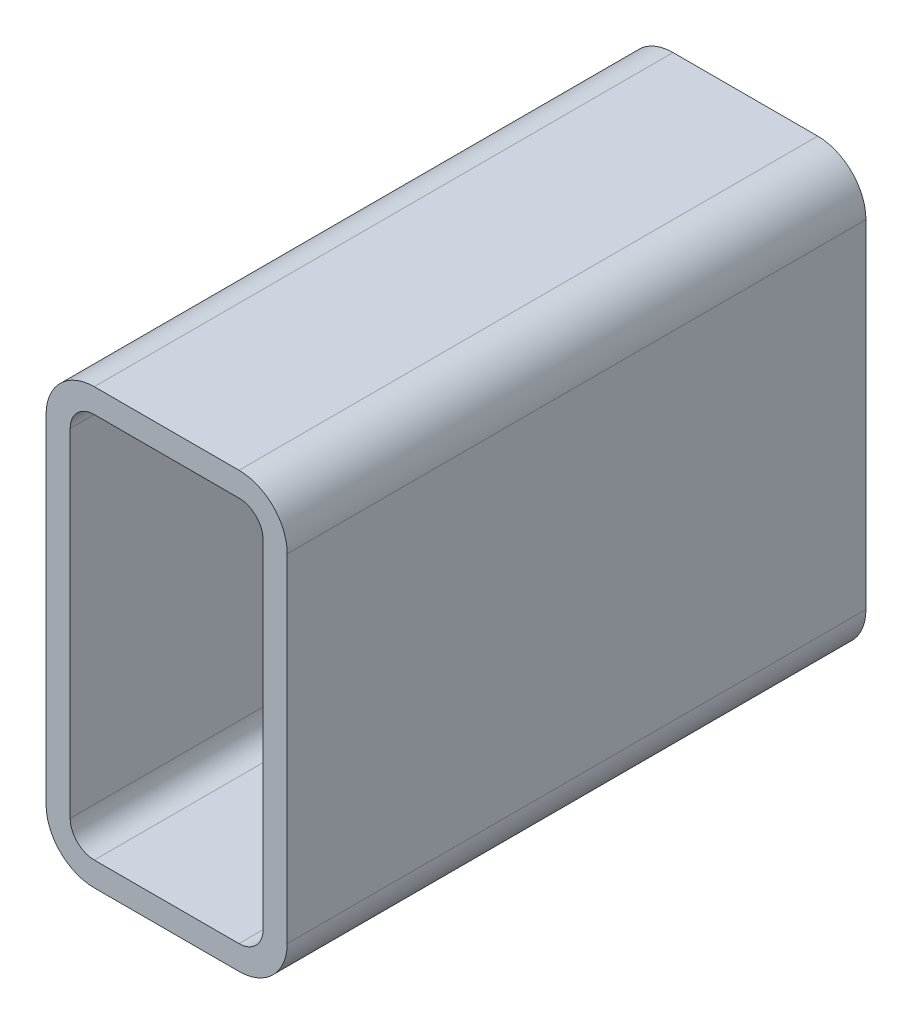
ISO-10303-21;
HEADER;
FILE_DESCRIPTION(('STEP AP214'),'2;1');
FILE_NAME('part.step','',(''),(''),'','','');
FILE_SCHEMA(('AUTOMOTIVE_DESIGN { 1 0 10303 214 1 1 1 1 }'));
ENDSEC;
DATA;
#1=APPLICATION_CONTEXT('core data for automotive mechanical design processes');
#2=APPLICATION_PROTOCOL_DEFINITION('international standard','automotive_design',2000,#1);
#3=PRODUCT_CONTEXT('',#1,'mechanical');
#4=PRODUCT('Part','Part','',(#3));
#5=PRODUCT_RELATED_PRODUCT_CATEGORY('part','',(#4));
#6=PRODUCT_DEFINITION_FORMATION('','',#4);
#7=PRODUCT_DEFINITION_CONTEXT('part definition',#1,'design');
#8=PRODUCT_DEFINITION('design','',#6,#7);
#9=PRODUCT_DEFINITION_SHAPE('','',#8);
#10=(LENGTH_UNIT() NAMED_UNIT(*) SI_UNIT(.MILLI.,.METRE.));
#11=(NAMED_UNIT(*) PLANE_ANGLE_UNIT() SI_UNIT($,.RADIAN.));
#12=(NAMED_UNIT(*) SI_UNIT($,.STERADIAN.) SOLID_ANGLE_UNIT());
#13=UNCERTAINTY_MEASURE_WITH_UNIT(LENGTH_MEASURE(1.E-05),#10,'distance_accuracy_value','');
#14=(GEOMETRIC_REPRESENTATION_CONTEXT(3) GLOBAL_UNCERTAINTY_ASSIGNED_CONTEXT((#13)) GLOBAL_UNIT_ASSIGNED_CONTEXT((#10,
#11,#12)) REPRESENTATION_CONTEXT('',''));
#15=CARTESIAN_POINT('',(0.,0.,0.));
#16=DIRECTION('',(0.,0.,1.));
#17=DIRECTION('',(1.,0.,0.));
#18=AXIS2_PLACEMENT_3D('',#15,#16,#17);
#19=CARTESIAN_POINT('',(26.2612396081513,205.143222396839,304.8));
#20=DIRECTION('',(0.,0.,1.));
#21=DIRECTION('',(1.,0.,0.));
#22=AXIS2_PLACEMENT_3D('',#19,#20,#21);
#23=PLANE('',#22);
#24=CARTESIAN_POINT('',(26.2612396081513,205.143222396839,304.8));
#25=DIRECTION('',(0.,0.,1.));
#26=DIRECTION('',(1.,0.,0.));
#27=AXIS2_PLACEMENT_3D('',#24,#25,#26);
#28=CIRCLE('',#27,25.4);
#29=CARTESIAN_POINT('',(26.2612396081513,230.543222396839,304.8));
#30=VERTEX_POINT('',#29);
#31=CARTESIAN_POINT('',(0.8612396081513,205.143222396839,304.8));
#32=VERTEX_POINT('',#31);
#33=EDGE_CURVE('E211',#30,#32,#28,.T.);
#34=ORIENTED_EDGE('',*,*,#33,.T.);
#35=DIRECTION('',(0.,-1.,0.));
#36=VECTOR('',#35,1.);
#37=CARTESIAN_POINT('',(0.8612396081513,27.3432223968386,304.8));
#38=LINE('',#37,#36);
#39=CARTESIAN_POINT('',(0.861239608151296,27.3432223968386,304.8));
#40=VERTEX_POINT('',#39);
#41=EDGE_CURVE('E214',#32,#40,#38,.T.);
#42=ORIENTED_EDGE('',*,*,#41,.T.);
#43=CARTESIAN_POINT('',(26.2612396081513,27.3432223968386,304.8));
#44=DIRECTION('',(0.,0.,1.));
#45=DIRECTION('',(1.,0.,0.));
#46=AXIS2_PLACEMENT_3D('',#43,#44,#45);
#47=CIRCLE('',#46,25.4);
#48=CARTESIAN_POINT('',(26.2612396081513,1.94322239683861,304.8));
#49=VERTEX_POINT('',#48);
#50=EDGE_CURVE('E217',#40,#49,#47,.T.);
#51=ORIENTED_EDGE('',*,*,#50,.T.);
#52=DIRECTION('',(1.,0.,0.));
#53=VECTOR('',#52,1.);
#54=CARTESIAN_POINT('',(102.461239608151,1.94322239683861,304.8));
#55=LINE('',#54,#53);
#56=CARTESIAN_POINT('',(102.461239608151,1.94322239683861,304.8));
#57=VERTEX_POINT('',#56);
#58=EDGE_CURVE('E219',#49,#57,#55,.T.);
#59=ORIENTED_EDGE('',*,*,#58,.T.);
#60=CARTESIAN_POINT('',(102.461239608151,27.3432223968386,304.8));
#61=DIRECTION('',(0.,0.,1.));
#62=DIRECTION('',(1.,0.,0.));
#63=AXIS2_PLACEMENT_3D('',#60,#61,#62);
#64=CIRCLE('',#63,25.4);
#65=CARTESIAN_POINT('',(127.861239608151,27.3432223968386,304.8));
#66=VERTEX_POINT('',#65);
#67=EDGE_CURVE('E221',#57,#66,#64,.T.);
#68=ORIENTED_EDGE('',*,*,#67,.T.);
#69=DIRECTION('',(0.,1.,0.));
#70=VECTOR('',#69,1.);
#71=CARTESIAN_POINT('',(127.861239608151,205.143222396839,304.8));
#72=LINE('',#71,#70);
#73=CARTESIAN_POINT('',(127.861239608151,205.143222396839,304.8));
#74=VERTEX_POINT('',#73);
#75=EDGE_CURVE('E223',#66,#74,#72,.T.);
#76=ORIENTED_EDGE('',*,*,#75,.T.);
#77=CARTESIAN_POINT('',(102.461239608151,205.143222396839,304.8));
#78=DIRECTION('',(0.,0.,1.));
#79=DIRECTION('',(1.,0.,0.));
#80=AXIS2_PLACEMENT_3D('',#77,#78,#79);
#81=CIRCLE('',#80,25.4);
#82=CARTESIAN_POINT('',(102.461239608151,230.543222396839,304.8));
#83=VERTEX_POINT('',#82);
#84=EDGE_CURVE('E225',#74,#83,#81,.T.);
#85=ORIENTED_EDGE('',*,*,#84,.T.);
#86=DIRECTION('',(-1.,0.,0.));
#87=VECTOR('',#86,1.);
#88=CARTESIAN_POINT('',(26.2612396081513,230.543222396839,304.8));
#89=LINE('',#88,#87);
#90=EDGE_CURVE('E227',#83,#30,#89,.T.);
#91=ORIENTED_EDGE('',*,*,#90,.T.);
#92=EDGE_LOOP('',(#34,#42,#51,#59,#68,#76,#85,#91));
#93=FACE_BOUND('',#92,.T.);
#94=DIRECTION('',(0.,-1.,0.));
#95=VECTOR('',#94,1.);
#96=CARTESIAN_POINT('',(13.5612396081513,27.3432223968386,304.8));
#97=LINE('',#96,#95);
#98=CARTESIAN_POINT('',(13.5612396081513,205.143222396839,304.8));
#99=VERTEX_POINT('',#98);
#100=CARTESIAN_POINT('',(13.5612396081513,27.3432223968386,304.8));
#101=VERTEX_POINT('',#100);
#102=EDGE_CURVE('E154',#99,#101,#97,.T.);
#103=ORIENTED_EDGE('',*,*,#102,.F.);
#104=CARTESIAN_POINT('',(26.2612396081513,205.143222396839,304.8));
#105=DIRECTION('',(0.,0.,1.));
#106=DIRECTION('',(1.,0.,0.));
#107=AXIS2_PLACEMENT_3D('',#104,#105,#106);
#108=CIRCLE('',#107,12.7);
#109=CARTESIAN_POINT('',(26.2612396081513,217.843222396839,304.8));
#110=VERTEX_POINT('',#109);
#111=EDGE_CURVE('E146',#110,#99,#108,.T.);
#112=ORIENTED_EDGE('',*,*,#111,.F.);
#113=DIRECTION('',(-1.,0.,0.));
#114=VECTOR('',#113,1.);
#115=CARTESIAN_POINT('',(26.2612396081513,217.843222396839,304.8));
#116=LINE('',#115,#114);
#117=CARTESIAN_POINT('',(102.461239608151,217.843222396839,304.8));
#118=VERTEX_POINT('',#117);
#119=EDGE_CURVE('E179',#118,#110,#116,.T.);
#120=ORIENTED_EDGE('',*,*,#119,.F.);
#121=CARTESIAN_POINT('',(102.461239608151,205.143222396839,304.8));
#122=DIRECTION('',(0.,0.,1.));
#123=DIRECTION('',(1.,0.,0.));
#124=AXIS2_PLACEMENT_3D('',#121,#122,#123);
#125=CIRCLE('',#124,12.7);
#126=CARTESIAN_POINT('',(115.161239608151,205.143222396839,304.8));
#127=VERTEX_POINT('',#126);
#128=EDGE_CURVE('E177',#127,#118,#125,.T.);
#129=ORIENTED_EDGE('',*,*,#128,.F.);
#130=DIRECTION('',(0.,1.,0.));
#131=VECTOR('',#130,1.);
#132=CARTESIAN_POINT('',(115.161239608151,205.143222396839,304.8));
#133=LINE('',#132,#131);
#134=CARTESIAN_POINT('',(115.161239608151,27.3432223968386,304.8));
#135=VERTEX_POINT('',#134);
#136=EDGE_CURVE('E175',#135,#127,#133,.T.);
#137=ORIENTED_EDGE('',*,*,#136,.F.);
#138=CARTESIAN_POINT('',(102.461239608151,27.3432223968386,304.8));
#139=DIRECTION('',(0.,0.,1.));
#140=DIRECTION('',(1.,0.,0.));
#141=AXIS2_PLACEMENT_3D('',#138,#139,#140);
#142=CIRCLE('',#141,12.7);
#143=CARTESIAN_POINT('',(102.461239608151,14.6432223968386,304.8));
#144=VERTEX_POINT('',#143);
#145=EDGE_CURVE('E173',#144,#135,#142,.T.);
#146=ORIENTED_EDGE('',*,*,#145,.F.);
#147=DIRECTION('',(1.,0.,0.));
#148=VECTOR('',#147,1.);
#149=CARTESIAN_POINT('',(102.461239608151,14.6432223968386,304.8));
#150=LINE('',#149,#148);
#151=CARTESIAN_POINT('',(26.2612396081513,14.6432223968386,304.8));
#152=VERTEX_POINT('',#151);
#153=EDGE_CURVE('E169',#152,#144,#150,.T.);
#154=ORIENTED_EDGE('',*,*,#153,.F.);
#155=CARTESIAN_POINT('',(26.2612396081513,27.3432223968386,304.8));
#156=DIRECTION('',(0.,0.,1.));
#157=DIRECTION('',(1.,0.,0.));
#158=AXIS2_PLACEMENT_3D('',#155,#156,#157);
#159=CIRCLE('',#158,12.7);
#160=EDGE_CURVE('E167',#101,#152,#159,.T.);
#161=ORIENTED_EDGE('',*,*,#160,.F.);
#162=EDGE_LOOP('',(#103,#112,#120,#129,#137,#146,#154,#161));
#163=FACE_BOUND('',#162,.T.);
#164=ADVANCED_FACE('F33',(#93,#163),#23,.T.);
#165=CARTESIAN_POINT('',(26.2612396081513,205.143222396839,0.));
#166=DIRECTION('',(0.,0.,1.));
#167=DIRECTION('',(1.,0.,0.));
#168=AXIS2_PLACEMENT_3D('',#165,#166,#167);
#169=PLANE('',#168);
#170=CARTESIAN_POINT('',(26.2612396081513,205.143222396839,0.));
#171=DIRECTION('',(0.,0.,1.));
#172=DIRECTION('',(1.,0.,0.));
#173=AXIS2_PLACEMENT_3D('',#170,#171,#172);
#174=CIRCLE('',#173,25.4);
#175=CARTESIAN_POINT('',(26.2612396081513,230.543222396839,0.));
#176=VERTEX_POINT('',#175);
#177=CARTESIAN_POINT('',(0.8612396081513,205.143222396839,0.));
#178=VERTEX_POINT('',#177);
#179=EDGE_CURVE('E162',#176,#178,#174,.T.);
#180=ORIENTED_EDGE('',*,*,#179,.F.);
#181=DIRECTION('',(-1.,0.,0.));
#182=VECTOR('',#181,1.);
#183=CARTESIAN_POINT('',(26.2612396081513,230.543222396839,0.));
#184=LINE('',#183,#182);
#185=CARTESIAN_POINT('',(102.461239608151,230.543222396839,0.));
#186=VERTEX_POINT('',#185);
#187=EDGE_CURVE('E215',#186,#176,#184,.T.);
#188=ORIENTED_EDGE('',*,*,#187,.F.);
#189=CARTESIAN_POINT('',(102.461239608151,205.143222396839,0.));
#190=DIRECTION('',(0.,0.,1.));
#191=DIRECTION('',(1.,0.,0.));
#192=AXIS2_PLACEMENT_3D('',#189,#190,#191);
#193=CIRCLE('',#192,25.4);
#194=CARTESIAN_POINT('',(127.861239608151,205.143222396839,0.));
#195=VERTEX_POINT('',#194);
#196=EDGE_CURVE('E242',#195,#186,#193,.T.);
#197=ORIENTED_EDGE('',*,*,#196,.F.);
#198=DIRECTION('',(0.,1.,0.));
#199=VECTOR('',#198,1.);
#200=CARTESIAN_POINT('',(127.861239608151,205.143222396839,0.));
#201=LINE('',#200,#199);
#202=CARTESIAN_POINT('',(127.861239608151,27.3432223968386,0.));
#203=VERTEX_POINT('',#202);
#204=EDGE_CURVE('E240',#203,#195,#201,.T.);
#205=ORIENTED_EDGE('',*,*,#204,.F.);
#206=CARTESIAN_POINT('',(102.461239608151,27.3432223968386,0.));
#207=DIRECTION('',(0.,0.,1.));
#208=DIRECTION('',(1.,0.,0.));
#209=AXIS2_PLACEMENT_3D('',#206,#207,#208);
#210=CIRCLE('',#209,25.4);
#211=CARTESIAN_POINT('',(102.461239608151,1.94322239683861,0.));
#212=VERTEX_POINT('',#211);
#213=EDGE_CURVE('E238',#212,#203,#210,.T.);
#214=ORIENTED_EDGE('',*,*,#213,.F.);
#215=DIRECTION('',(1.,0.,0.));
#216=VECTOR('',#215,1.);
#217=CARTESIAN_POINT('',(102.461239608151,1.94322239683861,0.));
#218=LINE('',#217,#216);
#219=CARTESIAN_POINT('',(26.2612396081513,1.94322239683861,0.));
#220=VERTEX_POINT('',#219);
#221=EDGE_CURVE('E236',#220,#212,#218,.T.);
#222=ORIENTED_EDGE('',*,*,#221,.F.);
#223=CARTESIAN_POINT('',(26.2612396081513,27.3432223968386,0.));
#224=DIRECTION('',(0.,0.,1.));
#225=DIRECTION('',(1.,0.,0.));
#226=AXIS2_PLACEMENT_3D('',#223,#224,#225);
#227=CIRCLE('',#226,25.4);
#228=CARTESIAN_POINT('',(0.861239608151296,27.3432223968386,0.));
#229=VERTEX_POINT('',#228);
#230=EDGE_CURVE('E234',#229,#220,#227,.T.);
#231=ORIENTED_EDGE('',*,*,#230,.F.);
#232=DIRECTION('',(0.,-1.,0.));
#233=VECTOR('',#232,1.);
#234=CARTESIAN_POINT('',(0.8612396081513,27.3432223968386,0.));
#235=LINE('',#234,#233);
#236=EDGE_CURVE('E232',#178,#229,#235,.T.);
#237=ORIENTED_EDGE('',*,*,#236,.F.);
#238=EDGE_LOOP('',(#180,#188,#197,#205,#214,#222,#231,#237));
#239=FACE_BOUND('',#238,.T.);
#240=CARTESIAN_POINT('',(26.2612396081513,205.143222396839,0.));
#241=DIRECTION('',(0.,0.,1.));
#242=DIRECTION('',(1.,0.,0.));
#243=AXIS2_PLACEMENT_3D('',#240,#241,#242);
#244=CIRCLE('',#243,12.7);
#245=CARTESIAN_POINT('',(26.2612396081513,217.843222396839,0.));
#246=VERTEX_POINT('',#245);
#247=CARTESIAN_POINT('',(13.5612396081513,205.143222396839,0.));
#248=VERTEX_POINT('',#247);
#249=EDGE_CURVE('E56',#246,#248,#244,.T.);
#250=ORIENTED_EDGE('',*,*,#249,.T.);
#251=DIRECTION('',(0.,-1.,0.));
#252=VECTOR('',#251,1.);
#253=CARTESIAN_POINT('',(13.5612396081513,27.3432223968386,0.));
#254=LINE('',#253,#252);
#255=CARTESIAN_POINT('',(13.5612396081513,27.3432223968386,0.));
#256=VERTEX_POINT('',#255);
#257=EDGE_CURVE('E161',#248,#256,#254,.T.);
#258=ORIENTED_EDGE('',*,*,#257,.T.);
#259=CARTESIAN_POINT('',(26.2612396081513,27.3432223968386,0.));
#260=DIRECTION('',(0.,0.,1.));
#261=DIRECTION('',(1.,0.,0.));
#262=AXIS2_PLACEMENT_3D('',#259,#260,#261);
#263=CIRCLE('',#262,12.7);
#264=CARTESIAN_POINT('',(26.2612396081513,14.6432223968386,0.));
#265=VERTEX_POINT('',#264);
#266=EDGE_CURVE('E183',#256,#265,#263,.T.);
#267=ORIENTED_EDGE('',*,*,#266,.T.);
#268=DIRECTION('',(1.,0.,0.));
#269=VECTOR('',#268,1.);
#270=CARTESIAN_POINT('',(102.461239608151,14.6432223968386,0.));
#271=LINE('',#270,#269);
#272=CARTESIAN_POINT('',(102.461239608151,14.6432223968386,0.));
#273=VERTEX_POINT('',#272);
#274=EDGE_CURVE('E186',#265,#273,#271,.T.);
#275=ORIENTED_EDGE('',*,*,#274,.T.);
#276=CARTESIAN_POINT('',(102.461239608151,27.3432223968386,0.));
#277=DIRECTION('',(0.,0.,1.));
#278=DIRECTION('',(1.,0.,0.));
#279=AXIS2_PLACEMENT_3D('',#276,#277,#278);
#280=CIRCLE('',#279,12.7);
#281=CARTESIAN_POINT('',(115.161239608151,27.3432223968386,0.));
#282=VERTEX_POINT('',#281);
#283=EDGE_CURVE('E189',#273,#282,#280,.T.);
#284=ORIENTED_EDGE('',*,*,#283,.T.);
#285=DIRECTION('',(0.,1.,0.));
#286=VECTOR('',#285,1.);
#287=CARTESIAN_POINT('',(115.161239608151,205.143222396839,0.));
#288=LINE('',#287,#286);
#289=CARTESIAN_POINT('',(115.161239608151,205.143222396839,0.));
#290=VERTEX_POINT('',#289);
#291=EDGE_CURVE('E192',#282,#290,#288,.T.);
#292=ORIENTED_EDGE('',*,*,#291,.T.);
#293=CARTESIAN_POINT('',(102.461239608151,205.143222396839,0.));
#294=DIRECTION('',(0.,0.,1.));
#295=DIRECTION('',(1.,0.,0.));
#296=AXIS2_PLACEMENT_3D('',#293,#294,#295);
#297=CIRCLE('',#296,12.7);
#298=CARTESIAN_POINT('',(102.461239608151,217.843222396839,0.));
#299=VERTEX_POINT('',#298);
#300=EDGE_CURVE('E195',#290,#299,#297,.T.);
#301=ORIENTED_EDGE('',*,*,#300,.T.);
#302=DIRECTION('',(-1.,0.,0.));
#303=VECTOR('',#302,1.);
#304=CARTESIAN_POINT('',(26.2612396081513,217.843222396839,0.));
#305=LINE('',#304,#303);
#306=EDGE_CURVE('E155',#299,#246,#305,.T.);
#307=ORIENTED_EDGE('',*,*,#306,.T.);
#308=EDGE_LOOP('',(#250,#258,#267,#275,#284,#292,#301,#307));
#309=FACE_BOUND('',#308,.T.);
#310=ADVANCED_FACE('F272',(#239,#309),#169,.F.);
#311=CARTESIAN_POINT('',(26.2612396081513,205.143222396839,304.8));
#312=DIRECTION('',(0.,0.,-1.));
#313=DIRECTION('',(-1.,0.,0.));
#314=AXIS2_PLACEMENT_3D('',#311,#312,#313);
#315=CYLINDRICAL_SURFACE('',#314,25.4);
#316=ORIENTED_EDGE('',*,*,#179,.T.);
#317=DIRECTION('',(0.,0.,-1.));
#318=VECTOR('',#317,1.);
#319=CARTESIAN_POINT('',(0.8612396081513,205.143222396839,304.8));
#320=LINE('',#319,#318);
#321=EDGE_CURVE('E11',#32,#178,#320,.T.);
#322=ORIENTED_EDGE('',*,*,#321,.F.);
#323=ORIENTED_EDGE('',*,*,#33,.F.);
#324=DIRECTION('',(0.,0.,-1.));
#325=VECTOR('',#324,1.);
#326=CARTESIAN_POINT('',(26.2612396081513,230.543222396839,304.8));
#327=LINE('',#326,#325);
#328=EDGE_CURVE('E229',#30,#176,#327,.T.);
#329=ORIENTED_EDGE('',*,*,#328,.T.);
#330=EDGE_LOOP('',(#316,#322,#323,#329));
#331=FACE_BOUND('',#330,.T.);
#332=ADVANCED_FACE('F35',(#331),#315,.T.);
#333=CARTESIAN_POINT('',(0.8612396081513,27.3432223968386,304.8));
#334=DIRECTION('',(1.,0.,0.));
#335=DIRECTION('',(0.,0.,-1.));
#336=AXIS2_PLACEMENT_3D('',#333,#334,#335);
#337=PLANE('',#336);
#338=ORIENTED_EDGE('',*,*,#236,.T.);
#339=DIRECTION('',(0.,0.,-1.));
#340=VECTOR('',#339,1.);
#341=CARTESIAN_POINT('',(0.861239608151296,27.3432223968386,304.8));
#342=LINE('',#341,#340);
#343=EDGE_CURVE('E41',#40,#229,#342,.T.);
#344=ORIENTED_EDGE('',*,*,#343,.F.);
#345=ORIENTED_EDGE('',*,*,#41,.F.);
#346=ORIENTED_EDGE('',*,*,#321,.T.);
#347=EDGE_LOOP('',(#338,#344,#345,#346));
#348=FACE_BOUND('',#347,.T.);
#349=ADVANCED_FACE('F289',(#348),#337,.F.);
#350=CARTESIAN_POINT('',(26.2612396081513,27.3432223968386,304.8));
#351=DIRECTION('',(0.,0.,-1.));
#352=DIRECTION('',(-1.,0.,0.));
#353=AXIS2_PLACEMENT_3D('',#350,#351,#352);
#354=CYLINDRICAL_SURFACE('',#353,25.4);
#355=ORIENTED_EDGE('',*,*,#230,.T.);
#356=DIRECTION('',(0.,0.,-1.));
#357=VECTOR('',#356,1.);
#358=CARTESIAN_POINT('',(26.2612396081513,1.94322239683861,304.8));
#359=LINE('',#358,#357);
#360=EDGE_CURVE('E259',#49,#220,#359,.T.);
#361=ORIENTED_EDGE('',*,*,#360,.F.);
#362=ORIENTED_EDGE('',*,*,#50,.F.);
#363=ORIENTED_EDGE('',*,*,#343,.T.);
#364=EDGE_LOOP('',(#355,#361,#362,#363));
#365=FACE_BOUND('',#364,.T.);
#366=ADVANCED_FACE('F266',(#365),#354,.T.);
#367=CARTESIAN_POINT('',(102.461239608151,1.94322239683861,304.8));
#368=DIRECTION('',(0.,1.,0.));
#369=DIRECTION('',(0.,0.,1.));
#370=AXIS2_PLACEMENT_3D('',#367,#368,#369);
#371=PLANE('',#370);
#372=ORIENTED_EDGE('',*,*,#221,.T.);
#373=DIRECTION('',(0.,0.,-1.));
#374=VECTOR('',#373,1.);
#375=CARTESIAN_POINT('',(102.461239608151,1.94322239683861,304.8));
#376=LINE('',#375,#374);
#377=EDGE_CURVE('E256',#57,#212,#376,.T.);
#378=ORIENTED_EDGE('',*,*,#377,.F.);
#379=ORIENTED_EDGE('',*,*,#58,.F.);
#380=ORIENTED_EDGE('',*,*,#360,.T.);
#381=EDGE_LOOP('',(#372,#378,#379,#380));
#382=FACE_BOUND('',#381,.T.);
#383=ADVANCED_FACE('F278',(#382),#371,.F.);
#384=CARTESIAN_POINT('',(102.461239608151,27.3432223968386,304.8));
#385=DIRECTION('',(0.,0.,-1.));
#386=DIRECTION('',(-1.,0.,0.));
#387=AXIS2_PLACEMENT_3D('',#384,#385,#386);
#388=CYLINDRICAL_SURFACE('',#387,25.4);
#389=ORIENTED_EDGE('',*,*,#213,.T.);
#390=DIRECTION('',(0.,0.,-1.));
#391=VECTOR('',#390,1.);
#392=CARTESIAN_POINT('',(127.861239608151,27.3432223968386,304.8));
#393=LINE('',#392,#391);
#394=EDGE_CURVE('E253',#66,#203,#393,.T.);
#395=ORIENTED_EDGE('',*,*,#394,.F.);
#396=ORIENTED_EDGE('',*,*,#67,.F.);
#397=ORIENTED_EDGE('',*,*,#377,.T.);
#398=EDGE_LOOP('',(#389,#395,#396,#397));
#399=FACE_BOUND('',#398,.T.);
#400=ADVANCED_FACE('F282',(#399),#388,.T.);
#401=CARTESIAN_POINT('',(127.861239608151,205.143222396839,304.8));
#402=DIRECTION('',(-1.,0.,0.));
#403=DIRECTION('',(0.,0.,1.));
#404=AXIS2_PLACEMENT_3D('',#401,#402,#403);
#405=PLANE('',#404);
#406=ORIENTED_EDGE('',*,*,#204,.T.);
#407=DIRECTION('',(0.,0.,-1.));
#408=VECTOR('',#407,1.);
#409=CARTESIAN_POINT('',(127.861239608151,205.143222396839,304.8));
#410=LINE('',#409,#408);
#411=EDGE_CURVE('E250',#74,#195,#410,.T.);
#412=ORIENTED_EDGE('',*,*,#411,.F.);
#413=ORIENTED_EDGE('',*,*,#75,.F.);
#414=ORIENTED_EDGE('',*,*,#394,.T.);
#415=EDGE_LOOP('',(#406,#412,#413,#414));
#416=FACE_BOUND('',#415,.T.);
#417=ADVANCED_FACE('F302',(#416),#405,.F.);
#418=CARTESIAN_POINT('',(102.461239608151,205.143222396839,304.8));
#419=DIRECTION('',(0.,0.,-1.));
#420=DIRECTION('',(-1.,0.,0.));
#421=AXIS2_PLACEMENT_3D('',#418,#419,#420);
#422=CYLINDRICAL_SURFACE('',#421,25.4);
#423=ORIENTED_EDGE('',*,*,#196,.T.);
#424=DIRECTION('',(0.,0.,-1.));
#425=VECTOR('',#424,1.);
#426=CARTESIAN_POINT('',(102.461239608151,230.543222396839,304.8));
#427=LINE('',#426,#425);
#428=EDGE_CURVE('E247',#83,#186,#427,.T.);
#429=ORIENTED_EDGE('',*,*,#428,.F.);
#430=ORIENTED_EDGE('',*,*,#84,.F.);
#431=ORIENTED_EDGE('',*,*,#411,.T.);
#432=EDGE_LOOP('',(#423,#429,#430,#431));
#433=FACE_BOUND('',#432,.T.);
#434=ADVANCED_FACE('F300',(#433),#422,.T.);
#435=CARTESIAN_POINT('',(26.2612396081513,230.543222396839,304.8));
#436=DIRECTION('',(0.,-1.,0.));
#437=DIRECTION('',(0.,0.,-1.));
#438=AXIS2_PLACEMENT_3D('',#435,#436,#437);
#439=PLANE('',#438);
#440=ORIENTED_EDGE('',*,*,#187,.T.);
#441=ORIENTED_EDGE('',*,*,#328,.F.);
#442=ORIENTED_EDGE('',*,*,#90,.F.);
#443=ORIENTED_EDGE('',*,*,#428,.T.);
#444=EDGE_LOOP('',(#440,#441,#442,#443));
#445=FACE_BOUND('',#444,.T.);
#446=ADVANCED_FACE('F295',(#445),#439,.F.);
#447=CARTESIAN_POINT('',(26.2612396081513,205.143222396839,304.8));
#448=DIRECTION('',(0.,0.,-1.));
#449=DIRECTION('',(-1.,0.,0.));
#450=AXIS2_PLACEMENT_3D('',#447,#448,#449);
#451=CYLINDRICAL_SURFACE('',#450,12.7);
#452=ORIENTED_EDGE('',*,*,#249,.F.);
#453=DIRECTION('',(0.,0.,-1.));
#454=VECTOR('',#453,1.);
#455=CARTESIAN_POINT('',(26.2612396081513,217.843222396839,304.8));
#456=LINE('',#455,#454);
#457=EDGE_CURVE('E150',#110,#246,#456,.T.);
#458=ORIENTED_EDGE('',*,*,#457,.F.);
#459=ORIENTED_EDGE('',*,*,#111,.T.);
#460=DIRECTION('',(0.,0.,-1.));
#461=VECTOR('',#460,1.);
#462=CARTESIAN_POINT('',(13.5612396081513,205.143222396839,304.8));
#463=LINE('',#462,#461);
#464=EDGE_CURVE('E149',#99,#248,#463,.T.);
#465=ORIENTED_EDGE('',*,*,#464,.T.);
#466=EDGE_LOOP('',(#452,#458,#459,#465));
#467=FACE_BOUND('',#466,.T.);
#468=ADVANCED_FACE('F148',(#467),#451,.F.);
#469=CARTESIAN_POINT('',(13.5612396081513,27.3432223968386,304.8));
#470=DIRECTION('',(1.,0.,0.));
#471=DIRECTION('',(0.,0.,-1.));
#472=AXIS2_PLACEMENT_3D('',#469,#470,#471);
#473=PLANE('',#472);
#474=ORIENTED_EDGE('',*,*,#257,.F.);
#475=ORIENTED_EDGE('',*,*,#464,.F.);
#476=ORIENTED_EDGE('',*,*,#102,.T.);
#477=DIRECTION('',(0.,0.,-1.));
#478=VECTOR('',#477,1.);
#479=CARTESIAN_POINT('',(13.5612396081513,27.3432223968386,304.8));
#480=LINE('',#479,#478);
#481=EDGE_CURVE('E163',#101,#256,#480,.T.);
#482=ORIENTED_EDGE('',*,*,#481,.T.);
#483=EDGE_LOOP('',(#474,#475,#476,#482));
#484=FACE_BOUND('',#483,.T.);
#485=ADVANCED_FACE('F158',(#484),#473,.T.);
#486=CARTESIAN_POINT('',(26.2612396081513,27.3432223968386,304.8));
#487=DIRECTION('',(0.,0.,-1.));
#488=DIRECTION('',(-1.,0.,0.));
#489=AXIS2_PLACEMENT_3D('',#486,#487,#488);
#490=CYLINDRICAL_SURFACE('',#489,12.7);
#491=ORIENTED_EDGE('',*,*,#266,.F.);
#492=ORIENTED_EDGE('',*,*,#481,.F.);
#493=ORIENTED_EDGE('',*,*,#160,.T.);
#494=DIRECTION('',(0.,0.,-1.));
#495=VECTOR('',#494,1.);
#496=CARTESIAN_POINT('',(26.2612396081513,14.6432223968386,304.8));
#497=LINE('',#496,#495);
#498=EDGE_CURVE('E208',#152,#265,#497,.T.);
#499=ORIENTED_EDGE('',*,*,#498,.T.);
#500=EDGE_LOOP('',(#491,#492,#493,#499));
#501=FACE_BOUND('',#500,.T.);
#502=ADVANCED_FACE('F327',(#501),#490,.F.);
#503=CARTESIAN_POINT('',(102.461239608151,14.6432223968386,304.8));
#504=DIRECTION('',(0.,1.,0.));
#505=DIRECTION('',(0.,0.,1.));
#506=AXIS2_PLACEMENT_3D('',#503,#504,#505);
#507=PLANE('',#506);
#508=ORIENTED_EDGE('',*,*,#274,.F.);
#509=ORIENTED_EDGE('',*,*,#498,.F.);
#510=ORIENTED_EDGE('',*,*,#153,.T.);
#511=DIRECTION('',(0.,0.,-1.));
#512=VECTOR('',#511,1.);
#513=CARTESIAN_POINT('',(102.461239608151,14.6432223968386,304.8));
#514=LINE('',#513,#512);
#515=EDGE_CURVE('E206',#144,#273,#514,.T.);
#516=ORIENTED_EDGE('',*,*,#515,.T.);
#517=EDGE_LOOP('',(#508,#509,#510,#516));
#518=FACE_BOUND('',#517,.T.);
#519=ADVANCED_FACE('F331',(#518),#507,.T.);
#520=CARTESIAN_POINT('',(102.461239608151,27.3432223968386,304.8));
#521=DIRECTION('',(0.,0.,-1.));
#522=DIRECTION('',(-1.,0.,0.));
#523=AXIS2_PLACEMENT_3D('',#520,#521,#522);
#524=CYLINDRICAL_SURFACE('',#523,12.7);
#525=ORIENTED_EDGE('',*,*,#283,.F.);
#526=ORIENTED_EDGE('',*,*,#515,.F.);
#527=ORIENTED_EDGE('',*,*,#145,.T.);
#528=DIRECTION('',(0.,0.,-1.));
#529=VECTOR('',#528,1.);
#530=CARTESIAN_POINT('',(115.161239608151,27.3432223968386,304.8));
#531=LINE('',#530,#529);
#532=EDGE_CURVE('E204',#135,#282,#531,.T.);
#533=ORIENTED_EDGE('',*,*,#532,.T.);
#534=EDGE_LOOP('',(#525,#526,#527,#533));
#535=FACE_BOUND('',#534,.T.);
#536=ADVANCED_FACE('F337',(#535),#524,.F.);
#537=CARTESIAN_POINT('',(115.161239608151,205.143222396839,304.8));
#538=DIRECTION('',(-1.,0.,0.));
#539=DIRECTION('',(0.,0.,1.));
#540=AXIS2_PLACEMENT_3D('',#537,#538,#539);
#541=PLANE('',#540);
#542=ORIENTED_EDGE('',*,*,#291,.F.);
#543=ORIENTED_EDGE('',*,*,#532,.F.);
#544=ORIENTED_EDGE('',*,*,#136,.T.);
#545=DIRECTION('',(0.,0.,-1.));
#546=VECTOR('',#545,1.);
#547=CARTESIAN_POINT('',(115.161239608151,205.143222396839,304.8));
#548=LINE('',#547,#546);
#549=EDGE_CURVE('E202',#127,#290,#548,.T.);
#550=ORIENTED_EDGE('',*,*,#549,.T.);
#551=EDGE_LOOP('',(#542,#543,#544,#550));
#552=FACE_BOUND('',#551,.T.);
#553=ADVANCED_FACE('F341',(#552),#541,.T.);
#554=CARTESIAN_POINT('',(102.461239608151,205.143222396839,304.8));
#555=DIRECTION('',(0.,0.,-1.));
#556=DIRECTION('',(-1.,0.,0.));
#557=AXIS2_PLACEMENT_3D('',#554,#555,#556);
#558=CYLINDRICAL_SURFACE('',#557,12.7);
#559=ORIENTED_EDGE('',*,*,#300,.F.);
#560=ORIENTED_EDGE('',*,*,#549,.F.);
#561=ORIENTED_EDGE('',*,*,#128,.T.);
#562=DIRECTION('',(0.,0.,-1.));
#563=VECTOR('',#562,1.);
#564=CARTESIAN_POINT('',(102.461239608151,217.843222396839,304.8));
#565=LINE('',#564,#563);
#566=EDGE_CURVE('E48',#118,#299,#565,.T.);
#567=ORIENTED_EDGE('',*,*,#566,.T.);
#568=EDGE_LOOP('',(#559,#560,#561,#567));
#569=FACE_BOUND('',#568,.T.);
#570=ADVANCED_FACE('F345',(#569),#558,.F.);
#571=CARTESIAN_POINT('',(26.2612396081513,217.843222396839,304.8));
#572=DIRECTION('',(0.,-1.,0.));
#573=DIRECTION('',(0.,0.,-1.));
#574=AXIS2_PLACEMENT_3D('',#571,#572,#573);
#575=PLANE('',#574);
#576=ORIENTED_EDGE('',*,*,#306,.F.);
#577=ORIENTED_EDGE('',*,*,#566,.F.);
#578=ORIENTED_EDGE('',*,*,#119,.T.);
#579=ORIENTED_EDGE('',*,*,#457,.T.);
#580=EDGE_LOOP('',(#576,#577,#578,#579));
#581=FACE_BOUND('',#580,.T.);
#582=ADVANCED_FACE('F349',(#581),#575,.T.);
#583=CLOSED_SHELL('',(#164,#310,#332,#349,#366,#383,#400,#417,#434,#446,#468,#485,#502,#519,
#536,#553,#570,#582));
#584=MANIFOLD_SOLID_BREP('B2',#583);
#585=ADVANCED_BREP_SHAPE_REPRESENTATION('',(#18,#584),#14);
#586=SHAPE_DEFINITION_REPRESENTATION(#9,#585);
ENDSEC;
END-ISO-10303-21;
